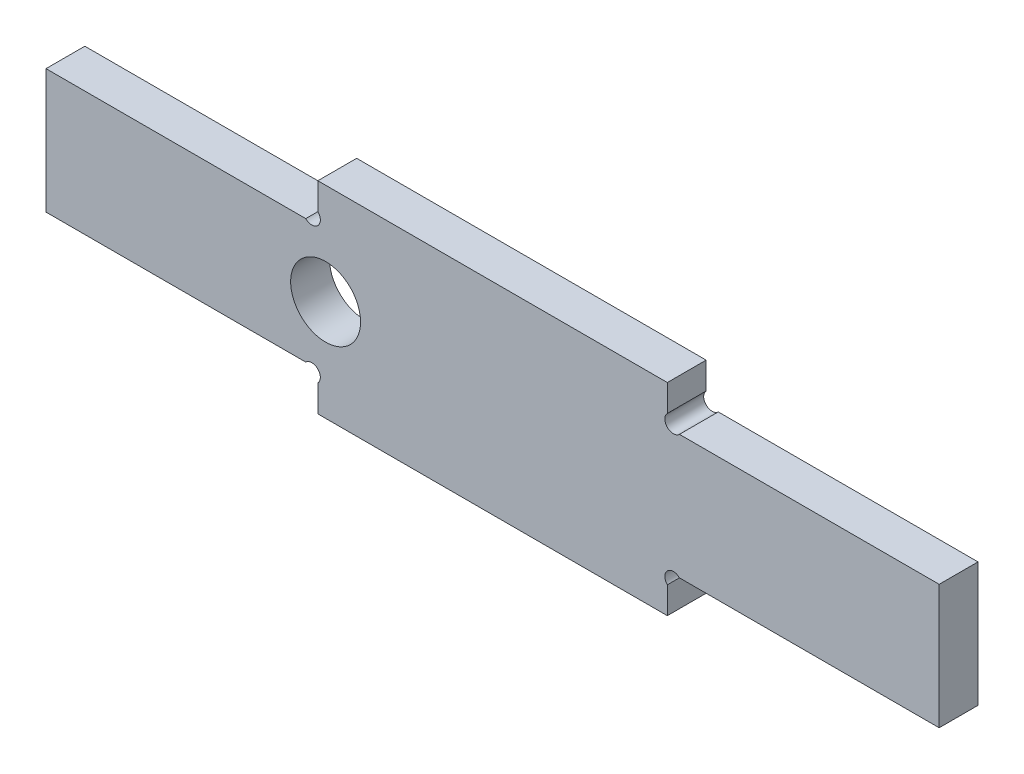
ISO-10303-21;
HEADER;
FILE_DESCRIPTION(('STEP AP214'),'2;1');
FILE_NAME('part.step','',(''),(''),'','','');
FILE_SCHEMA(('AUTOMOTIVE_DESIGN { 1 0 10303 214 1 1 1 1 }'));
ENDSEC;
DATA;
#1=APPLICATION_CONTEXT('core data for automotive mechanical design processes');
#2=APPLICATION_PROTOCOL_DEFINITION('international standard','automotive_design',2000,#1);
#3=PRODUCT_CONTEXT('',#1,'mechanical');
#4=PRODUCT('Part','Part','',(#3));
#5=PRODUCT_RELATED_PRODUCT_CATEGORY('part','',(#4));
#6=PRODUCT_DEFINITION_FORMATION('','',#4);
#7=PRODUCT_DEFINITION_CONTEXT('part definition',#1,'design');
#8=PRODUCT_DEFINITION('design','',#6,#7);
#9=PRODUCT_DEFINITION_SHAPE('','',#8);
#10=(LENGTH_UNIT() NAMED_UNIT(*) SI_UNIT(.MILLI.,.METRE.));
#11=(NAMED_UNIT(*) PLANE_ANGLE_UNIT() SI_UNIT($,.RADIAN.));
#12=(NAMED_UNIT(*) SI_UNIT($,.STERADIAN.) SOLID_ANGLE_UNIT());
#13=UNCERTAINTY_MEASURE_WITH_UNIT(LENGTH_MEASURE(1.E-05),#10,'distance_accuracy_value','');
#14=(GEOMETRIC_REPRESENTATION_CONTEXT(3) GLOBAL_UNCERTAINTY_ASSIGNED_CONTEXT((#13)) GLOBAL_UNIT_ASSIGNED_CONTEXT((#10,
#11,#12)) REPRESENTATION_CONTEXT('',''));
#15=CARTESIAN_POINT('',(0.,0.,0.));
#16=DIRECTION('',(0.,0.,1.));
#17=DIRECTION('',(1.,0.,0.));
#18=AXIS2_PLACEMENT_3D('',#15,#16,#17);
#19=CARTESIAN_POINT('',(0.,26.,5.));
#20=DIRECTION('',(0.,0.,-1.));
#21=DIRECTION('',(-1.,0.,0.));
#22=AXIS2_PLACEMENT_3D('',#19,#20,#21);
#23=PLANE('',#22);
#24=CARTESIAN_POINT('',(36.,13.,5.));
#25=DIRECTION('',(0.,0.,1.));
#26=DIRECTION('',(1.,0.,0.));
#27=AXIS2_PLACEMENT_3D('',#24,#25,#26);
#28=CIRCLE('',#27,4.5);
#29=CARTESIAN_POINT('',(40.5,13.,5.));
#30=VERTEX_POINT('',#29);
#31=EDGE_CURVE('E167',#30,#30,#28,.T.);
#32=ORIENTED_EDGE('',*,*,#31,.F.);
#33=EDGE_LOOP('',(#32));
#34=FACE_BOUND('',#33,.T.);
#35=DIRECTION('',(0.,1.,0.));
#36=VECTOR('',#35,1.);
#37=CARTESIAN_POINT('',(80.,0.,5.));
#38=LINE('',#37,#36);
#39=CARTESIAN_POINT('',(80.,0.,5.));
#40=VERTEX_POINT('',#39);
#41=CARTESIAN_POINT('',(80.,3.4443650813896,5.));
#42=VERTEX_POINT('',#41);
#43=EDGE_CURVE('E50',#40,#42,#38,.T.);
#44=ORIENTED_EDGE('',*,*,#43,.T.);
#45=CARTESIAN_POINT('',(80.7778174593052,4.2221825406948,5.));
#46=DIRECTION('',(0.,0.,-1.));
#47=DIRECTION('',(-1.,0.,0.));
#48=AXIS2_PLACEMENT_3D('',#45,#46,#47);
#49=CIRCLE('',#48,1.1);
#50=CARTESIAN_POINT('',(81.5556349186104,5.,5.));
#51=VERTEX_POINT('',#50);
#52=EDGE_CURVE('E161',#42,#51,#49,.T.);
#53=ORIENTED_EDGE('',*,*,#52,.T.);
#54=DIRECTION('',(1.,0.,0.));
#55=VECTOR('',#54,1.);
#56=CARTESIAN_POINT('',(115.,5.,5.));
#57=LINE('',#56,#55);
#58=CARTESIAN_POINT('',(115.,5.,5.));
#59=VERTEX_POINT('',#58);
#60=EDGE_CURVE('E171',#51,#59,#57,.T.);
#61=ORIENTED_EDGE('',*,*,#60,.T.);
#62=DIRECTION('',(0.,-1.,0.));
#63=VECTOR('',#62,1.);
#64=CARTESIAN_POINT('',(115.,0.,5.));
#65=LINE('',#64,#63);
#66=CARTESIAN_POINT('',(115.,21.,5.));
#67=VERTEX_POINT('',#66);
#68=EDGE_CURVE('E199',#67,#59,#65,.T.);
#69=ORIENTED_EDGE('',*,*,#68,.F.);
#70=DIRECTION('',(-1.,0.,0.));
#71=VECTOR('',#70,1.);
#72=CARTESIAN_POINT('',(115.,21.,5.));
#73=LINE('',#72,#71);
#74=CARTESIAN_POINT('',(81.5556349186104,21.,5.));
#75=VERTEX_POINT('',#74);
#76=EDGE_CURVE('E58',#67,#75,#73,.T.);
#77=ORIENTED_EDGE('',*,*,#76,.T.);
#78=CARTESIAN_POINT('',(80.7778174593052,21.7778174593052,5.));
#79=DIRECTION('',(0.,0.,-1.));
#80=DIRECTION('',(-1.,0.,0.));
#81=AXIS2_PLACEMENT_3D('',#78,#79,#80);
#82=CIRCLE('',#81,1.1);
#83=CARTESIAN_POINT('',(80.,22.5556349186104,5.));
#84=VERTEX_POINT('',#83);
#85=EDGE_CURVE('E175',#75,#84,#82,.T.);
#86=ORIENTED_EDGE('',*,*,#85,.T.);
#87=DIRECTION('',(0.,1.,0.));
#88=VECTOR('',#87,1.);
#89=CARTESIAN_POINT('',(80.,26.,5.));
#90=LINE('',#89,#88);
#91=CARTESIAN_POINT('',(80.,26.,5.));
#92=VERTEX_POINT('',#91);
#93=EDGE_CURVE('E190',#84,#92,#90,.T.);
#94=ORIENTED_EDGE('',*,*,#93,.T.);
#95=DIRECTION('',(-1.,0.,0.));
#96=VECTOR('',#95,1.);
#97=CARTESIAN_POINT('',(0.,26.,5.));
#98=LINE('',#97,#96);
#99=CARTESIAN_POINT('',(35.,26.,5.));
#100=VERTEX_POINT('',#99);
#101=EDGE_CURVE('E11',#92,#100,#98,.T.);
#102=ORIENTED_EDGE('',*,*,#101,.T.);
#103=DIRECTION('',(0.,1.,0.));
#104=VECTOR('',#103,1.);
#105=CARTESIAN_POINT('',(35.,26.,5.));
#106=LINE('',#105,#104);
#107=CARTESIAN_POINT('',(35.,22.5556349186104,5.));
#108=VERTEX_POINT('',#107);
#109=EDGE_CURVE('E242',#108,#100,#106,.T.);
#110=ORIENTED_EDGE('',*,*,#109,.F.);
#111=CARTESIAN_POINT('',(34.2221825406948,21.7778174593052,5.));
#112=DIRECTION('',(0.,0.,1.));
#113=DIRECTION('',(1.,0.,0.));
#114=AXIS2_PLACEMENT_3D('',#111,#112,#113);
#115=CIRCLE('',#114,1.1);
#116=CARTESIAN_POINT('',(33.4443650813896,21.,5.));
#117=VERTEX_POINT('',#116);
#118=EDGE_CURVE('E217',#117,#108,#115,.T.);
#119=ORIENTED_EDGE('',*,*,#118,.F.);
#120=DIRECTION('',(1.,0.,0.));
#121=VECTOR('',#120,1.);
#122=CARTESIAN_POINT('',(0.,21.,5.));
#123=LINE('',#122,#121);
#124=CARTESIAN_POINT('',(0.,21.,5.));
#125=VERTEX_POINT('',#124);
#126=EDGE_CURVE('E239',#125,#117,#123,.T.);
#127=ORIENTED_EDGE('',*,*,#126,.F.);
#128=DIRECTION('',(0.,-1.,0.));
#129=VECTOR('',#128,1.);
#130=CARTESIAN_POINT('',(0.,0.,5.));
#131=LINE('',#130,#129);
#132=CARTESIAN_POINT('',(0.,5.,5.));
#133=VERTEX_POINT('',#132);
#134=EDGE_CURVE('E254',#125,#133,#131,.T.);
#135=ORIENTED_EDGE('',*,*,#134,.T.);
#136=DIRECTION('',(-1.,0.,0.));
#137=VECTOR('',#136,1.);
#138=CARTESIAN_POINT('',(0.,5.,5.));
#139=LINE('',#138,#137);
#140=CARTESIAN_POINT('',(33.4443650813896,5.,5.));
#141=VERTEX_POINT('',#140);
#142=EDGE_CURVE('E229',#141,#133,#139,.T.);
#143=ORIENTED_EDGE('',*,*,#142,.F.);
#144=CARTESIAN_POINT('',(34.2221825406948,4.2221825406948,5.));
#145=DIRECTION('',(0.,0.,1.));
#146=DIRECTION('',(1.,0.,0.));
#147=AXIS2_PLACEMENT_3D('',#144,#145,#146);
#148=CIRCLE('',#147,1.1);
#149=CARTESIAN_POINT('',(35.,3.44436508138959,5.));
#150=VERTEX_POINT('',#149);
#151=EDGE_CURVE('E211',#150,#141,#148,.T.);
#152=ORIENTED_EDGE('',*,*,#151,.F.);
#153=DIRECTION('',(0.,1.,0.));
#154=VECTOR('',#153,1.);
#155=CARTESIAN_POINT('',(35.,0.,5.));
#156=LINE('',#155,#154);
#157=CARTESIAN_POINT('',(35.,0.,5.));
#158=VERTEX_POINT('',#157);
#159=EDGE_CURVE('E226',#158,#150,#156,.T.);
#160=ORIENTED_EDGE('',*,*,#159,.F.);
#161=DIRECTION('',(1.,0.,0.));
#162=VECTOR('',#161,1.);
#163=CARTESIAN_POINT('',(0.,0.,5.));
#164=LINE('',#163,#162);
#165=EDGE_CURVE('E42',#158,#40,#164,.T.);
#166=ORIENTED_EDGE('',*,*,#165,.T.);
#167=EDGE_LOOP('',(#44,#53,#61,#69,#77,#86,#94,#102,#110,#119,#127,#135,#143,#152,#160,#166));
#168=FACE_BOUND('',#167,.T.);
#169=ADVANCED_FACE('F33',(#34,#168),#23,.F.);
#170=CARTESIAN_POINT('',(0.,26.,0.));
#171=DIRECTION('',(0.,0.,-1.));
#172=DIRECTION('',(-1.,0.,0.));
#173=AXIS2_PLACEMENT_3D('',#170,#171,#172);
#174=PLANE('',#173);
#175=CARTESIAN_POINT('',(36.,13.,0.));
#176=DIRECTION('',(0.,0.,-1.));
#177=DIRECTION('',(-1.,0.,0.));
#178=AXIS2_PLACEMENT_3D('',#175,#176,#177);
#179=CIRCLE('',#178,4.5);
#180=CARTESIAN_POINT('',(31.5,13.,0.));
#181=VERTEX_POINT('',#180);
#182=EDGE_CURVE('E302',#181,#181,#179,.F.);
#183=ORIENTED_EDGE('',*,*,#182,.T.);
#184=EDGE_LOOP('',(#183));
#185=FACE_BOUND('',#184,.T.);
#186=CARTESIAN_POINT('',(80.7778174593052,4.2221825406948,0.));
#187=DIRECTION('',(0.,0.,-1.));
#188=DIRECTION('',(-1.,0.,0.));
#189=AXIS2_PLACEMENT_3D('',#186,#187,#188);
#190=CIRCLE('',#189,1.1);
#191=CARTESIAN_POINT('',(80.,3.4443650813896,0.));
#192=VERTEX_POINT('',#191);
#193=CARTESIAN_POINT('',(81.5556349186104,5.,0.));
#194=VERTEX_POINT('',#193);
#195=EDGE_CURVE('E149',#192,#194,#190,.T.);
#196=ORIENTED_EDGE('',*,*,#195,.F.);
#197=DIRECTION('',(0.,1.,0.));
#198=VECTOR('',#197,1.);
#199=CARTESIAN_POINT('',(80.,0.,0.));
#200=LINE('',#199,#198);
#201=CARTESIAN_POINT('',(80.,0.,0.));
#202=VERTEX_POINT('',#201);
#203=EDGE_CURVE('E154',#202,#192,#200,.T.);
#204=ORIENTED_EDGE('',*,*,#203,.F.);
#205=DIRECTION('',(1.,0.,0.));
#206=VECTOR('',#205,1.);
#207=CARTESIAN_POINT('',(0.,0.,0.));
#208=LINE('',#207,#206);
#209=CARTESIAN_POINT('',(35.,0.,0.));
#210=VERTEX_POINT('',#209);
#211=EDGE_CURVE('E260',#210,#202,#208,.T.);
#212=ORIENTED_EDGE('',*,*,#211,.F.);
#213=DIRECTION('',(0.,1.,0.));
#214=VECTOR('',#213,1.);
#215=CARTESIAN_POINT('',(35.,0.,0.));
#216=LINE('',#215,#214);
#217=CARTESIAN_POINT('',(35.,3.44436508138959,0.));
#218=VERTEX_POINT('',#217);
#219=EDGE_CURVE('E221',#210,#218,#216,.T.);
#220=ORIENTED_EDGE('',*,*,#219,.T.);
#221=CARTESIAN_POINT('',(34.2221825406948,4.2221825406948,0.));
#222=DIRECTION('',(0.,0.,-1.));
#223=DIRECTION('',(-1.,0.,0.));
#224=AXIS2_PLACEMENT_3D('',#221,#222,#223);
#225=CIRCLE('',#224,1.1);
#226=CARTESIAN_POINT('',(33.4443650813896,5.,0.));
#227=VERTEX_POINT('',#226);
#228=EDGE_CURVE('E213',#218,#227,#225,.F.);
#229=ORIENTED_EDGE('',*,*,#228,.T.);
#230=DIRECTION('',(-1.,0.,0.));
#231=VECTOR('',#230,1.);
#232=CARTESIAN_POINT('',(0.,5.,0.));
#233=LINE('',#232,#231);
#234=CARTESIAN_POINT('',(0.,5.,0.));
#235=VERTEX_POINT('',#234);
#236=EDGE_CURVE('E224',#227,#235,#233,.T.);
#237=ORIENTED_EDGE('',*,*,#236,.T.);
#238=DIRECTION('',(0.,-1.,0.));
#239=VECTOR('',#238,1.);
#240=CARTESIAN_POINT('',(0.,0.,0.));
#241=LINE('',#240,#239);
#242=CARTESIAN_POINT('',(0.,21.,0.));
#243=VERTEX_POINT('',#242);
#244=EDGE_CURVE('E253',#243,#235,#241,.T.);
#245=ORIENTED_EDGE('',*,*,#244,.F.);
#246=DIRECTION('',(1.,0.,0.));
#247=VECTOR('',#246,1.);
#248=CARTESIAN_POINT('',(0.,21.,0.));
#249=LINE('',#248,#247);
#250=CARTESIAN_POINT('',(33.4443650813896,21.,0.));
#251=VERTEX_POINT('',#250);
#252=EDGE_CURVE('E249',#243,#251,#249,.T.);
#253=ORIENTED_EDGE('',*,*,#252,.T.);
#254=CARTESIAN_POINT('',(34.2221825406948,21.7778174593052,0.));
#255=DIRECTION('',(0.,0.,-1.));
#256=DIRECTION('',(-1.,0.,0.));
#257=AXIS2_PLACEMENT_3D('',#254,#255,#256);
#258=CIRCLE('',#257,1.1);
#259=CARTESIAN_POINT('',(35.,22.5556349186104,0.));
#260=VERTEX_POINT('',#259);
#261=EDGE_CURVE('E219',#251,#260,#258,.F.);
#262=ORIENTED_EDGE('',*,*,#261,.T.);
#263=DIRECTION('',(0.,1.,0.));
#264=VECTOR('',#263,1.);
#265=CARTESIAN_POINT('',(35.,26.,0.));
#266=LINE('',#265,#264);
#267=CARTESIAN_POINT('',(35.,26.,0.));
#268=VERTEX_POINT('',#267);
#269=EDGE_CURVE('E235',#260,#268,#266,.T.);
#270=ORIENTED_EDGE('',*,*,#269,.T.);
#271=DIRECTION('',(-1.,0.,0.));
#272=VECTOR('',#271,1.);
#273=CARTESIAN_POINT('',(0.,26.,0.));
#274=LINE('',#273,#272);
#275=CARTESIAN_POINT('',(80.,26.,0.));
#276=VERTEX_POINT('',#275);
#277=EDGE_CURVE('E37',#276,#268,#274,.T.);
#278=ORIENTED_EDGE('',*,*,#277,.F.);
#279=DIRECTION('',(0.,1.,0.));
#280=VECTOR('',#279,1.);
#281=CARTESIAN_POINT('',(80.,26.,0.));
#282=LINE('',#281,#280);
#283=CARTESIAN_POINT('',(80.,22.5556349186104,0.));
#284=VERTEX_POINT('',#283);
#285=EDGE_CURVE('E185',#284,#276,#282,.T.);
#286=ORIENTED_EDGE('',*,*,#285,.F.);
#287=CARTESIAN_POINT('',(80.7778174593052,21.7778174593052,0.));
#288=DIRECTION('',(0.,0.,-1.));
#289=DIRECTION('',(-1.,0.,0.));
#290=AXIS2_PLACEMENT_3D('',#287,#288,#289);
#291=CIRCLE('',#290,1.1);
#292=CARTESIAN_POINT('',(81.5556349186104,21.,0.));
#293=VERTEX_POINT('',#292);
#294=EDGE_CURVE('E172',#293,#284,#291,.T.);
#295=ORIENTED_EDGE('',*,*,#294,.F.);
#296=DIRECTION('',(-1.,0.,0.));
#297=VECTOR('',#296,1.);
#298=CARTESIAN_POINT('',(115.,21.,0.));
#299=LINE('',#298,#297);
#300=CARTESIAN_POINT('',(115.,21.,0.));
#301=VERTEX_POINT('',#300);
#302=EDGE_CURVE('E187',#301,#293,#299,.T.);
#303=ORIENTED_EDGE('',*,*,#302,.F.);
#304=DIRECTION('',(0.,-1.,0.));
#305=VECTOR('',#304,1.);
#306=CARTESIAN_POINT('',(115.,0.,0.));
#307=LINE('',#306,#305);
#308=CARTESIAN_POINT('',(115.,5.,0.));
#309=VERTEX_POINT('',#308);
#310=EDGE_CURVE('E196',#301,#309,#307,.T.);
#311=ORIENTED_EDGE('',*,*,#310,.T.);
#312=DIRECTION('',(1.,0.,0.));
#313=VECTOR('',#312,1.);
#314=CARTESIAN_POINT('',(115.,5.,0.));
#315=LINE('',#314,#313);
#316=EDGE_CURVE('E157',#194,#309,#315,.T.);
#317=ORIENTED_EDGE('',*,*,#316,.F.);
#318=EDGE_LOOP('',(#196,#204,#212,#220,#229,#237,#245,#253,#262,#270,#278,#286,#295,#303,#311,#317));
#319=FACE_BOUND('',#318,.T.);
#320=ADVANCED_FACE('F151',(#185,#319),#174,.T.);
#321=CARTESIAN_POINT('',(80.,0.,-0.00100000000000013));
#322=DIRECTION('',(1.,0.,0.));
#323=DIRECTION('',(0.,0.,-1.));
#324=AXIS2_PLACEMENT_3D('',#321,#322,#323);
#325=PLANE('',#324);
#326=ORIENTED_EDGE('',*,*,#203,.T.);
#327=DIRECTION('',(0.,0.,1.));
#328=VECTOR('',#327,1.);
#329=CARTESIAN_POINT('',(80.,3.4443650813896,-0.00100000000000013));
#330=LINE('',#329,#328);
#331=EDGE_CURVE('E163',#42,#192,#330,.F.);
#332=ORIENTED_EDGE('',*,*,#331,.F.);
#333=ORIENTED_EDGE('',*,*,#43,.F.);
#334=DIRECTION('',(0.,0.,1.));
#335=VECTOR('',#334,1.);
#336=CARTESIAN_POINT('',(80.,0.,-0.00100000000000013));
#337=LINE('',#336,#335);
#338=EDGE_CURVE('E170',#202,#40,#337,.T.);
#339=ORIENTED_EDGE('',*,*,#338,.F.);
#340=EDGE_LOOP('',(#326,#332,#333,#339));
#341=FACE_BOUND('',#340,.T.);
#342=ADVANCED_FACE('F169',(#341),#325,.T.);
#343=CARTESIAN_POINT('',(115.,21.,-0.00100000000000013));
#344=DIRECTION('',(0.,1.,0.));
#345=DIRECTION('',(0.,0.,1.));
#346=AXIS2_PLACEMENT_3D('',#343,#344,#345);
#347=PLANE('',#346);
#348=ORIENTED_EDGE('',*,*,#302,.T.);
#349=DIRECTION('',(0.,0.,1.));
#350=VECTOR('',#349,1.);
#351=CARTESIAN_POINT('',(81.5556349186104,21.,-0.00100000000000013));
#352=LINE('',#351,#350);
#353=EDGE_CURVE('E166',#75,#293,#352,.F.);
#354=ORIENTED_EDGE('',*,*,#353,.F.);
#355=ORIENTED_EDGE('',*,*,#76,.F.);
#356=DIRECTION('',(0.,0.,1.));
#357=VECTOR('',#356,1.);
#358=CARTESIAN_POINT('',(115.,21.,-0.00100000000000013));
#359=LINE('',#358,#357);
#360=EDGE_CURVE('E194',#301,#67,#359,.T.);
#361=ORIENTED_EDGE('',*,*,#360,.F.);
#362=EDGE_LOOP('',(#348,#354,#355,#361));
#363=FACE_BOUND('',#362,.T.);
#364=ADVANCED_FACE('F290',(#363),#347,.T.);
#365=CARTESIAN_POINT('',(115.,5.,-0.00100000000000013));
#366=DIRECTION('',(0.,-1.,0.));
#367=DIRECTION('',(0.,0.,-1.));
#368=AXIS2_PLACEMENT_3D('',#365,#366,#367);
#369=PLANE('',#368);
#370=ORIENTED_EDGE('',*,*,#60,.F.);
#371=DIRECTION('',(0.,0.,1.));
#372=VECTOR('',#371,1.);
#373=CARTESIAN_POINT('',(81.5556349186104,5.,-0.00100000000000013));
#374=LINE('',#373,#372);
#375=EDGE_CURVE('E288',#194,#51,#374,.T.);
#376=ORIENTED_EDGE('',*,*,#375,.F.);
#377=ORIENTED_EDGE('',*,*,#316,.T.);
#378=DIRECTION('',(0.,0.,1.));
#379=VECTOR('',#378,1.);
#380=CARTESIAN_POINT('',(115.,5.,-0.00100000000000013));
#381=LINE('',#380,#379);
#382=EDGE_CURVE('E180',#309,#59,#381,.T.);
#383=ORIENTED_EDGE('',*,*,#382,.T.);
#384=EDGE_LOOP('',(#370,#376,#377,#383));
#385=FACE_BOUND('',#384,.T.);
#386=ADVANCED_FACE('F297',(#385),#369,.T.);
#387=CARTESIAN_POINT('',(80.,26.,-0.00100000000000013));
#388=DIRECTION('',(1.,0.,0.));
#389=DIRECTION('',(0.,0.,-1.));
#390=AXIS2_PLACEMENT_3D('',#387,#388,#389);
#391=PLANE('',#390);
#392=ORIENTED_EDGE('',*,*,#93,.F.);
#393=DIRECTION('',(0.,0.,1.));
#394=VECTOR('',#393,1.);
#395=CARTESIAN_POINT('',(80.,22.5556349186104,-0.00100000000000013));
#396=LINE('',#395,#394);
#397=EDGE_CURVE('E160',#284,#84,#396,.T.);
#398=ORIENTED_EDGE('',*,*,#397,.F.);
#399=ORIENTED_EDGE('',*,*,#285,.T.);
#400=DIRECTION('',(0.,0.,1.));
#401=VECTOR('',#400,1.);
#402=CARTESIAN_POINT('',(80.,26.,-0.00100000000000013));
#403=LINE('',#402,#401);
#404=EDGE_CURVE('E193',#276,#92,#403,.T.);
#405=ORIENTED_EDGE('',*,*,#404,.T.);
#406=EDGE_LOOP('',(#392,#398,#399,#405));
#407=FACE_BOUND('',#406,.T.);
#408=ADVANCED_FACE('F282',(#407),#391,.T.);
#409=CARTESIAN_POINT('',(115.,0.,5.));
#410=DIRECTION('',(1.,0.,0.));
#411=DIRECTION('',(0.,0.,-1.));
#412=AXIS2_PLACEMENT_3D('',#409,#410,#411);
#413=PLANE('',#412);
#414=ORIENTED_EDGE('',*,*,#68,.T.);
#415=ORIENTED_EDGE('',*,*,#382,.F.);
#416=ORIENTED_EDGE('',*,*,#310,.F.);
#417=ORIENTED_EDGE('',*,*,#360,.T.);
#418=EDGE_LOOP('',(#414,#415,#416,#417));
#419=FACE_BOUND('',#418,.T.);
#420=ADVANCED_FACE('F293',(#419),#413,.T.);
#421=CARTESIAN_POINT('',(0.,0.,5.));
#422=DIRECTION('',(0.,1.,0.));
#423=DIRECTION('',(0.,0.,1.));
#424=AXIS2_PLACEMENT_3D('',#421,#422,#423);
#425=PLANE('',#424);
#426=ORIENTED_EDGE('',*,*,#338,.T.);
#427=ORIENTED_EDGE('',*,*,#165,.F.);
#428=DIRECTION('',(0.,0.,1.));
#429=VECTOR('',#428,1.);
#430=CARTESIAN_POINT('',(35.,0.,-0.00100000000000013));
#431=LINE('',#430,#429);
#432=EDGE_CURVE('E231',#210,#158,#431,.T.);
#433=ORIENTED_EDGE('',*,*,#432,.F.);
#434=ORIENTED_EDGE('',*,*,#211,.T.);
#435=EDGE_LOOP('',(#426,#427,#433,#434));
#436=FACE_BOUND('',#435,.T.);
#437=ADVANCED_FACE('F322',(#436),#425,.F.);
#438=CARTESIAN_POINT('',(0.,26.,5.));
#439=DIRECTION('',(0.,-1.,0.));
#440=DIRECTION('',(0.,0.,-1.));
#441=AXIS2_PLACEMENT_3D('',#438,#439,#440);
#442=PLANE('',#441);
#443=ORIENTED_EDGE('',*,*,#404,.F.);
#444=ORIENTED_EDGE('',*,*,#277,.T.);
#445=DIRECTION('',(0.,0.,1.));
#446=VECTOR('',#445,1.);
#447=CARTESIAN_POINT('',(35.,26.,-0.00100000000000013));
#448=LINE('',#447,#446);
#449=EDGE_CURVE('E246',#268,#100,#448,.T.);
#450=ORIENTED_EDGE('',*,*,#449,.T.);
#451=ORIENTED_EDGE('',*,*,#101,.F.);
#452=EDGE_LOOP('',(#443,#444,#450,#451));
#453=FACE_BOUND('',#452,.T.);
#454=ADVANCED_FACE('F266',(#453),#442,.F.);
#455=CARTESIAN_POINT('',(0.,0.,5.));
#456=DIRECTION('',(1.,0.,0.));
#457=DIRECTION('',(0.,0.,-1.));
#458=AXIS2_PLACEMENT_3D('',#455,#456,#457);
#459=PLANE('',#458);
#460=ORIENTED_EDGE('',*,*,#244,.T.);
#461=DIRECTION('',(0.,0.,1.));
#462=VECTOR('',#461,1.);
#463=CARTESIAN_POINT('',(0.,5.,-0.00100000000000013));
#464=LINE('',#463,#462);
#465=EDGE_CURVE('E232',#235,#133,#464,.T.);
#466=ORIENTED_EDGE('',*,*,#465,.T.);
#467=ORIENTED_EDGE('',*,*,#134,.F.);
#468=DIRECTION('',(0.,0.,1.));
#469=VECTOR('',#468,1.);
#470=CARTESIAN_POINT('',(0.,21.,-0.00100000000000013));
#471=LINE('',#470,#469);
#472=EDGE_CURVE('E245',#243,#125,#471,.T.);
#473=ORIENTED_EDGE('',*,*,#472,.F.);
#474=EDGE_LOOP('',(#460,#466,#467,#473));
#475=FACE_BOUND('',#474,.T.);
#476=ADVANCED_FACE('F35',(#475),#459,.F.);
#477=CARTESIAN_POINT('',(35.,26.,-0.00100000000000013));
#478=DIRECTION('',(1.,0.,0.));
#479=DIRECTION('',(0.,0.,-1.));
#480=AXIS2_PLACEMENT_3D('',#477,#478,#479);
#481=PLANE('',#480);
#482=ORIENTED_EDGE('',*,*,#269,.F.);
#483=DIRECTION('',(0.,0.,1.));
#484=VECTOR('',#483,1.);
#485=CARTESIAN_POINT('',(35.,22.5556349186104,-0.00100000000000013));
#486=LINE('',#485,#484);
#487=EDGE_CURVE('E206',#108,#260,#486,.F.);
#488=ORIENTED_EDGE('',*,*,#487,.F.);
#489=ORIENTED_EDGE('',*,*,#109,.T.);
#490=ORIENTED_EDGE('',*,*,#449,.F.);
#491=EDGE_LOOP('',(#482,#488,#489,#490));
#492=FACE_BOUND('',#491,.T.);
#493=ADVANCED_FACE('F273',(#492),#481,.F.);
#494=CARTESIAN_POINT('',(0.,21.,-0.00100000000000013));
#495=DIRECTION('',(0.,-1.,0.));
#496=DIRECTION('',(0.,0.,-1.));
#497=AXIS2_PLACEMENT_3D('',#494,#495,#496);
#498=PLANE('',#497);
#499=ORIENTED_EDGE('',*,*,#126,.T.);
#500=DIRECTION('',(0.,0.,1.));
#501=VECTOR('',#500,1.);
#502=CARTESIAN_POINT('',(33.4443650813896,21.,-0.00100000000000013));
#503=LINE('',#502,#501);
#504=EDGE_CURVE('E215',#251,#117,#503,.T.);
#505=ORIENTED_EDGE('',*,*,#504,.F.);
#506=ORIENTED_EDGE('',*,*,#252,.F.);
#507=ORIENTED_EDGE('',*,*,#472,.T.);
#508=EDGE_LOOP('',(#499,#505,#506,#507));
#509=FACE_BOUND('',#508,.T.);
#510=ADVANCED_FACE('F318',(#509),#498,.F.);
#511=CARTESIAN_POINT('',(0.,5.,-0.00100000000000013));
#512=DIRECTION('',(0.,1.,0.));
#513=DIRECTION('',(0.,0.,1.));
#514=AXIS2_PLACEMENT_3D('',#511,#512,#513);
#515=PLANE('',#514);
#516=ORIENTED_EDGE('',*,*,#236,.F.);
#517=DIRECTION('',(0.,0.,1.));
#518=VECTOR('',#517,1.);
#519=CARTESIAN_POINT('',(33.4443650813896,5.,-0.00100000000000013));
#520=LINE('',#519,#518);
#521=EDGE_CURVE('E202',#141,#227,#520,.F.);
#522=ORIENTED_EDGE('',*,*,#521,.F.);
#523=ORIENTED_EDGE('',*,*,#142,.T.);
#524=ORIENTED_EDGE('',*,*,#465,.F.);
#525=EDGE_LOOP('',(#516,#522,#523,#524));
#526=FACE_BOUND('',#525,.T.);
#527=ADVANCED_FACE('F342',(#526),#515,.F.);
#528=CARTESIAN_POINT('',(35.,0.,-0.00100000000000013));
#529=DIRECTION('',(1.,0.,0.));
#530=DIRECTION('',(0.,0.,-1.));
#531=AXIS2_PLACEMENT_3D('',#528,#529,#530);
#532=PLANE('',#531);
#533=ORIENTED_EDGE('',*,*,#159,.T.);
#534=DIRECTION('',(0.,0.,1.));
#535=VECTOR('',#534,1.);
#536=CARTESIAN_POINT('',(35.,3.44436508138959,-0.00100000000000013));
#537=LINE('',#536,#535);
#538=EDGE_CURVE('E209',#218,#150,#537,.T.);
#539=ORIENTED_EDGE('',*,*,#538,.F.);
#540=ORIENTED_EDGE('',*,*,#219,.F.);
#541=ORIENTED_EDGE('',*,*,#432,.T.);
#542=EDGE_LOOP('',(#533,#539,#540,#541));
#543=FACE_BOUND('',#542,.T.);
#544=ADVANCED_FACE('F334',(#543),#532,.F.);
#545=CARTESIAN_POINT('',(34.2221825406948,21.7778174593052,-0.00100000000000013));
#546=DIRECTION('',(0.,0.,1.));
#547=DIRECTION('',(1.,0.,0.));
#548=AXIS2_PLACEMENT_3D('',#545,#546,#547);
#549=CYLINDRICAL_SURFACE('',#548,1.1);
#550=ORIENTED_EDGE('',*,*,#118,.T.);
#551=ORIENTED_EDGE('',*,*,#487,.T.);
#552=ORIENTED_EDGE('',*,*,#261,.F.);
#553=ORIENTED_EDGE('',*,*,#504,.T.);
#554=EDGE_LOOP('',(#550,#551,#552,#553));
#555=FACE_BOUND('',#554,.T.);
#556=ADVANCED_FACE('F349',(#555),#549,.F.);
#557=CARTESIAN_POINT('',(34.2221825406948,4.2221825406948,-0.00100000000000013));
#558=DIRECTION('',(0.,0.,1.));
#559=DIRECTION('',(1.,0.,0.));
#560=AXIS2_PLACEMENT_3D('',#557,#558,#559);
#561=CYLINDRICAL_SURFACE('',#560,1.1);
#562=ORIENTED_EDGE('',*,*,#151,.T.);
#563=ORIENTED_EDGE('',*,*,#521,.T.);
#564=ORIENTED_EDGE('',*,*,#228,.F.);
#565=ORIENTED_EDGE('',*,*,#538,.T.);
#566=EDGE_LOOP('',(#562,#563,#564,#565));
#567=FACE_BOUND('',#566,.T.);
#568=ADVANCED_FACE('F340',(#567),#561,.F.);
#569=CARTESIAN_POINT('',(80.7778174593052,21.7778174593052,-0.00100000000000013));
#570=DIRECTION('',(0.,0.,1.));
#571=DIRECTION('',(1.,0.,0.));
#572=AXIS2_PLACEMENT_3D('',#569,#570,#571);
#573=CYLINDRICAL_SURFACE('',#572,1.1);
#574=ORIENTED_EDGE('',*,*,#397,.T.);
#575=ORIENTED_EDGE('',*,*,#85,.F.);
#576=ORIENTED_EDGE('',*,*,#353,.T.);
#577=ORIENTED_EDGE('',*,*,#294,.T.);
#578=EDGE_LOOP('',(#574,#575,#576,#577));
#579=FACE_BOUND('',#578,.T.);
#580=ADVANCED_FACE('F287',(#579),#573,.F.);
#581=CARTESIAN_POINT('',(80.7778174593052,4.2221825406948,-0.00100000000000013));
#582=DIRECTION('',(0.,0.,1.));
#583=DIRECTION('',(1.,0.,0.));
#584=AXIS2_PLACEMENT_3D('',#581,#582,#583);
#585=CYLINDRICAL_SURFACE('',#584,1.1);
#586=ORIENTED_EDGE('',*,*,#195,.T.);
#587=ORIENTED_EDGE('',*,*,#375,.T.);
#588=ORIENTED_EDGE('',*,*,#52,.F.);
#589=ORIENTED_EDGE('',*,*,#331,.T.);
#590=EDGE_LOOP('',(#586,#587,#588,#589));
#591=FACE_BOUND('',#590,.T.);
#592=ADVANCED_FACE('F164',(#591),#585,.F.);
#593=CARTESIAN_POINT('',(36.,13.,-0.00100000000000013));
#594=DIRECTION('',(0.,0.,1.));
#595=DIRECTION('',(1.,0.,0.));
#596=AXIS2_PLACEMENT_3D('',#593,#594,#595);
#597=CYLINDRICAL_SURFACE('',#596,4.5);
#598=ORIENTED_EDGE('',*,*,#182,.F.);
#599=EDGE_LOOP('',(#598));
#600=FACE_BOUND('',#599,.T.);
#601=ORIENTED_EDGE('',*,*,#31,.T.);
#602=EDGE_LOOP('',(#601));
#603=FACE_BOUND('',#602,.T.);
#604=ADVANCED_FACE('F308',(#600,#603),#597,.F.);
#605=CLOSED_SHELL('',(#169,#320,#342,#364,#386,#408,#420,#437,#454,#476,#493,#510,#527,#544,
#556,#568,#580,#592,#604));
#606=MANIFOLD_SOLID_BREP('B2',#605);
#607=ADVANCED_BREP_SHAPE_REPRESENTATION('',(#18,#606),#14);
#608=SHAPE_DEFINITION_REPRESENTATION(#9,#607);
ENDSEC;
END-ISO-10303-21;
